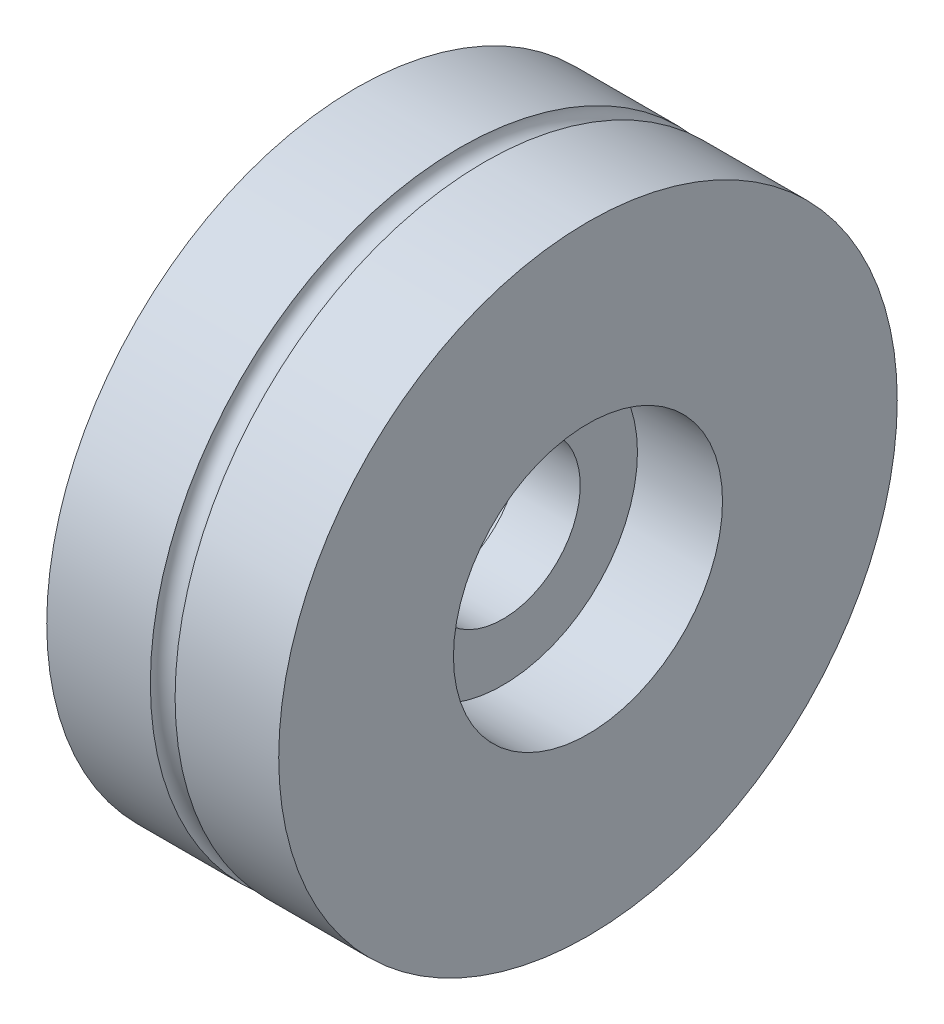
ISO-10303-21;
HEADER;
FILE_DESCRIPTION(('STEP AP214'),'2;1');
FILE_NAME('part.step','',(''),(''),'','','');
FILE_SCHEMA(('AUTOMOTIVE_DESIGN { 1 0 10303 214 1 1 1 1 }'));
ENDSEC;
DATA;
#1=APPLICATION_CONTEXT('core data for automotive mechanical design processes');
#2=APPLICATION_PROTOCOL_DEFINITION('international standard','automotive_design',2000,#1);
#3=PRODUCT_CONTEXT('',#1,'mechanical');
#4=PRODUCT('Part','Part','',(#3));
#5=PRODUCT_RELATED_PRODUCT_CATEGORY('part','',(#4));
#6=PRODUCT_DEFINITION_FORMATION('','',#4);
#7=PRODUCT_DEFINITION_CONTEXT('part definition',#1,'design');
#8=PRODUCT_DEFINITION('design','',#6,#7);
#9=PRODUCT_DEFINITION_SHAPE('','',#8);
#10=(LENGTH_UNIT() NAMED_UNIT(*) SI_UNIT(.MILLI.,.METRE.));
#11=(NAMED_UNIT(*) PLANE_ANGLE_UNIT() SI_UNIT($,.RADIAN.));
#12=(NAMED_UNIT(*) SI_UNIT($,.STERADIAN.) SOLID_ANGLE_UNIT());
#13=UNCERTAINTY_MEASURE_WITH_UNIT(LENGTH_MEASURE(1.E-05),#10,'distance_accuracy_value','');
#14=(GEOMETRIC_REPRESENTATION_CONTEXT(3) GLOBAL_UNCERTAINTY_ASSIGNED_CONTEXT((#13)) GLOBAL_UNIT_ASSIGNED_CONTEXT((#10,
#11,#12)) REPRESENTATION_CONTEXT('',''));
#15=CARTESIAN_POINT('',(0.,0.,0.));
#16=DIRECTION('',(0.,0.,1.));
#17=DIRECTION('',(1.,0.,0.));
#18=AXIS2_PLACEMENT_3D('',#15,#16,#17);
#19=CARTESIAN_POINT('',(2.54,6.35,0.));
#20=DIRECTION('',(-1.,0.,0.));
#21=DIRECTION('',(0.,0.,1.));
#22=AXIS2_PLACEMENT_3D('',#19,#20,#21);
#23=PLANE('',#22);
#24=CARTESIAN_POINT('',(2.54,0.,0.));
#25=DIRECTION('',(-1.,0.,0.));
#26=DIRECTION('',(0.,0.,1.));
#27=AXIS2_PLACEMENT_3D('',#24,#25,#26);
#28=CIRCLE('',#27,11.049);
#29=CARTESIAN_POINT('',(2.54,0.,11.049));
#30=VERTEX_POINT('',#29);
#31=EDGE_CURVE('E10',#30,#30,#28,.T.);
#32=ORIENTED_EDGE('',*,*,#31,.F.);
#33=EDGE_LOOP('',(#32));
#34=FACE_BOUND('',#33,.T.);
#35=CARTESIAN_POINT('',(2.54,0.,0.));
#36=DIRECTION('',(-1.,0.,0.));
#37=DIRECTION('',(0.,0.,1.));
#38=AXIS2_PLACEMENT_3D('',#35,#36,#37);
#39=CIRCLE('',#38,6.35);
#40=CARTESIAN_POINT('',(2.54,0.,6.35));
#41=VERTEX_POINT('',#40);
#42=EDGE_CURVE('E65',#41,#41,#39,.T.);
#43=ORIENTED_EDGE('',*,*,#42,.T.);
#44=EDGE_LOOP('',(#43));
#45=FACE_BOUND('',#44,.T.);
#46=ADVANCED_FACE('F31',(#34,#45),#23,.F.);
#47=CARTESIAN_POINT('',(-6.02987949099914,0.,0.));
#48=DIRECTION('',(-1.,0.,0.));
#49=DIRECTION('',(0.,0.,1.));
#50=AXIS2_PLACEMENT_3D('',#47,#48,#49);
#51=CYLINDRICAL_SURFACE('',#50,11.049);
#52=CARTESIAN_POINT('',(9.525,0.,0.));
#53=DIRECTION('',(-1.,0.,0.));
#54=DIRECTION('',(0.,0.,1.));
#55=AXIS2_PLACEMENT_3D('',#52,#53,#54);
#56=CIRCLE('',#55,11.049);
#57=CARTESIAN_POINT('',(9.525,0.,11.049));
#58=VERTEX_POINT('',#57);
#59=EDGE_CURVE('E37',#58,#58,#56,.T.);
#60=ORIENTED_EDGE('',*,*,#59,.F.);
#61=EDGE_LOOP('',(#60));
#62=FACE_BOUND('',#61,.T.);
#63=ORIENTED_EDGE('',*,*,#31,.T.);
#64=EDGE_LOOP('',(#63));
#65=FACE_BOUND('',#64,.T.);
#66=ADVANCED_FACE('F114',(#62,#65),#51,.F.);
#67=CARTESIAN_POINT('',(9.525,11.049,0.));
#68=DIRECTION('',(-1.,0.,0.));
#69=DIRECTION('',(0.,0.,1.));
#70=AXIS2_PLACEMENT_3D('',#67,#68,#69);
#71=PLANE('',#70);
#72=CARTESIAN_POINT('',(9.525,0.,0.));
#73=DIRECTION('',(-1.,0.,0.));
#74=DIRECTION('',(0.,0.,1.));
#75=AXIS2_PLACEMENT_3D('',#72,#73,#74);
#76=CIRCLE('',#75,25.4);
#77=CARTESIAN_POINT('',(9.525,0.,25.4));
#78=VERTEX_POINT('',#77);
#79=EDGE_CURVE('E41',#78,#78,#76,.T.);
#80=ORIENTED_EDGE('',*,*,#79,.F.);
#81=EDGE_LOOP('',(#80));
#82=FACE_BOUND('',#81,.T.);
#83=ORIENTED_EDGE('',*,*,#59,.T.);
#84=EDGE_LOOP('',(#83));
#85=FACE_BOUND('',#84,.T.);
#86=ADVANCED_FACE('F109',(#82,#85),#71,.F.);
#87=CARTESIAN_POINT('',(-6.02987949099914,0.,0.));
#88=DIRECTION('',(-1.,0.,0.));
#89=DIRECTION('',(0.,0.,1.));
#90=AXIS2_PLACEMENT_3D('',#87,#88,#89);
#91=CYLINDRICAL_SURFACE('',#90,25.4);
#92=CARTESIAN_POINT('',(1.016,0.,0.));
#93=DIRECTION('',(-1.,0.,0.));
#94=DIRECTION('',(0.,0.,1.));
#95=AXIS2_PLACEMENT_3D('',#92,#93,#94);
#96=CIRCLE('',#95,25.4);
#97=CARTESIAN_POINT('',(1.016,0.,25.4));
#98=VERTEX_POINT('',#97);
#99=EDGE_CURVE('E45',#98,#98,#96,.T.);
#100=ORIENTED_EDGE('',*,*,#99,.F.);
#101=EDGE_LOOP('',(#100));
#102=FACE_BOUND('',#101,.T.);
#103=ORIENTED_EDGE('',*,*,#79,.T.);
#104=EDGE_LOOP('',(#103));
#105=FACE_BOUND('',#104,.T.);
#106=ADVANCED_FACE('F103',(#102,#105),#91,.T.);
#107=CARTESIAN_POINT('',(0.,0.,0.));
#108=DIRECTION('',(-1.,0.,0.));
#109=DIRECTION('',(0.,0.,1.));
#110=AXIS2_PLACEMENT_3D('',#107,#108,#109);
#111=TOROIDAL_SURFACE('',#110,25.4,1.016);
#112=CARTESIAN_POINT('',(-1.016,0.,0.));
#113=DIRECTION('',(-1.,0.,0.));
#114=DIRECTION('',(0.,0.,1.));
#115=AXIS2_PLACEMENT_3D('',#112,#113,#114);
#116=CIRCLE('',#115,25.4);
#117=CARTESIAN_POINT('',(-1.016,0.,25.4));
#118=VERTEX_POINT('',#117);
#119=EDGE_CURVE('E50',#118,#118,#116,.T.);
#120=ORIENTED_EDGE('',*,*,#119,.F.);
#121=EDGE_LOOP('',(#120));
#122=FACE_BOUND('',#121,.T.);
#123=ORIENTED_EDGE('',*,*,#99,.T.);
#124=EDGE_LOOP('',(#123));
#125=FACE_BOUND('',#124,.T.);
#126=ADVANCED_FACE('F97',(#122,#125),#111,.F.);
#127=CARTESIAN_POINT('',(-6.02987949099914,0.,0.));
#128=DIRECTION('',(-1.,0.,0.));
#129=DIRECTION('',(0.,0.,1.));
#130=AXIS2_PLACEMENT_3D('',#127,#128,#129);
#131=CYLINDRICAL_SURFACE('',#130,25.4);
#132=CARTESIAN_POINT('',(-9.525,0.,0.));
#133=DIRECTION('',(-1.,0.,0.));
#134=DIRECTION('',(0.,0.,1.));
#135=AXIS2_PLACEMENT_3D('',#132,#133,#134);
#136=CIRCLE('',#135,25.4);
#137=CARTESIAN_POINT('',(-9.525,0.,25.4));
#138=VERTEX_POINT('',#137);
#139=EDGE_CURVE('E53',#138,#138,#136,.T.);
#140=ORIENTED_EDGE('',*,*,#139,.F.);
#141=EDGE_LOOP('',(#140));
#142=FACE_BOUND('',#141,.T.);
#143=ORIENTED_EDGE('',*,*,#119,.T.);
#144=EDGE_LOOP('',(#143));
#145=FACE_BOUND('',#144,.T.);
#146=ADVANCED_FACE('F91',(#142,#145),#131,.T.);
#147=CARTESIAN_POINT('',(-9.525,11.049,0.));
#148=DIRECTION('',(1.,0.,0.));
#149=DIRECTION('',(0.,0.,-1.));
#150=AXIS2_PLACEMENT_3D('',#147,#148,#149);
#151=PLANE('',#150);
#152=CARTESIAN_POINT('',(-9.525,0.,0.));
#153=DIRECTION('',(-1.,0.,0.));
#154=DIRECTION('',(0.,0.,1.));
#155=AXIS2_PLACEMENT_3D('',#152,#153,#154);
#156=CIRCLE('',#155,11.049);
#157=CARTESIAN_POINT('',(-9.525,0.,11.049));
#158=VERTEX_POINT('',#157);
#159=EDGE_CURVE('E56',#158,#158,#156,.T.);
#160=ORIENTED_EDGE('',*,*,#159,.F.);
#161=EDGE_LOOP('',(#160));
#162=FACE_BOUND('',#161,.T.);
#163=ORIENTED_EDGE('',*,*,#139,.T.);
#164=EDGE_LOOP('',(#163));
#165=FACE_BOUND('',#164,.T.);
#166=ADVANCED_FACE('F85',(#162,#165),#151,.F.);
#167=CARTESIAN_POINT('',(-6.02987949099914,0.,0.));
#168=DIRECTION('',(-1.,0.,0.));
#169=DIRECTION('',(0.,0.,1.));
#170=AXIS2_PLACEMENT_3D('',#167,#168,#169);
#171=CYLINDRICAL_SURFACE('',#170,11.049);
#172=CARTESIAN_POINT('',(-2.54,0.,0.));
#173=DIRECTION('',(-1.,0.,0.));
#174=DIRECTION('',(0.,0.,1.));
#175=AXIS2_PLACEMENT_3D('',#172,#173,#174);
#176=CIRCLE('',#175,11.049);
#177=CARTESIAN_POINT('',(-2.54,0.,11.049));
#178=VERTEX_POINT('',#177);
#179=EDGE_CURVE('E59',#178,#178,#176,.T.);
#180=ORIENTED_EDGE('',*,*,#179,.F.);
#181=EDGE_LOOP('',(#180));
#182=FACE_BOUND('',#181,.T.);
#183=ORIENTED_EDGE('',*,*,#159,.T.);
#184=EDGE_LOOP('',(#183));
#185=FACE_BOUND('',#184,.T.);
#186=ADVANCED_FACE('F79',(#182,#185),#171,.F.);
#187=CARTESIAN_POINT('',(-2.54,6.35,0.));
#188=DIRECTION('',(1.,0.,0.));
#189=DIRECTION('',(0.,0.,-1.));
#190=AXIS2_PLACEMENT_3D('',#187,#188,#189);
#191=PLANE('',#190);
#192=CARTESIAN_POINT('',(-2.54,0.,0.));
#193=DIRECTION('',(-1.,0.,0.));
#194=DIRECTION('',(0.,0.,1.));
#195=AXIS2_PLACEMENT_3D('',#192,#193,#194);
#196=CIRCLE('',#195,6.35);
#197=CARTESIAN_POINT('',(-2.54,0.,6.35));
#198=VERTEX_POINT('',#197);
#199=EDGE_CURVE('E62',#198,#198,#196,.T.);
#200=ORIENTED_EDGE('',*,*,#199,.F.);
#201=EDGE_LOOP('',(#200));
#202=FACE_BOUND('',#201,.T.);
#203=ORIENTED_EDGE('',*,*,#179,.T.);
#204=EDGE_LOOP('',(#203));
#205=FACE_BOUND('',#204,.T.);
#206=ADVANCED_FACE('F73',(#202,#205),#191,.F.);
#207=CARTESIAN_POINT('',(-6.02987949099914,0.,0.));
#208=DIRECTION('',(-1.,0.,0.));
#209=DIRECTION('',(0.,0.,1.));
#210=AXIS2_PLACEMENT_3D('',#207,#208,#209);
#211=CYLINDRICAL_SURFACE('',#210,6.35);
#212=ORIENTED_EDGE('',*,*,#42,.F.);
#213=EDGE_LOOP('',(#212));
#214=FACE_BOUND('',#213,.T.);
#215=ORIENTED_EDGE('',*,*,#199,.T.);
#216=EDGE_LOOP('',(#215));
#217=FACE_BOUND('',#216,.T.);
#218=ADVANCED_FACE('F70',(#214,#217),#211,.F.);
#219=CLOSED_SHELL('',(#46,#66,#86,#106,#126,#146,#166,#186,#206,#218));
#220=MANIFOLD_SOLID_BREP('B2',#219);
#221=ADVANCED_BREP_SHAPE_REPRESENTATION('',(#18,#220),#14);
#222=SHAPE_DEFINITION_REPRESENTATION(#9,#221);
ENDSEC;
END-ISO-10303-21;
